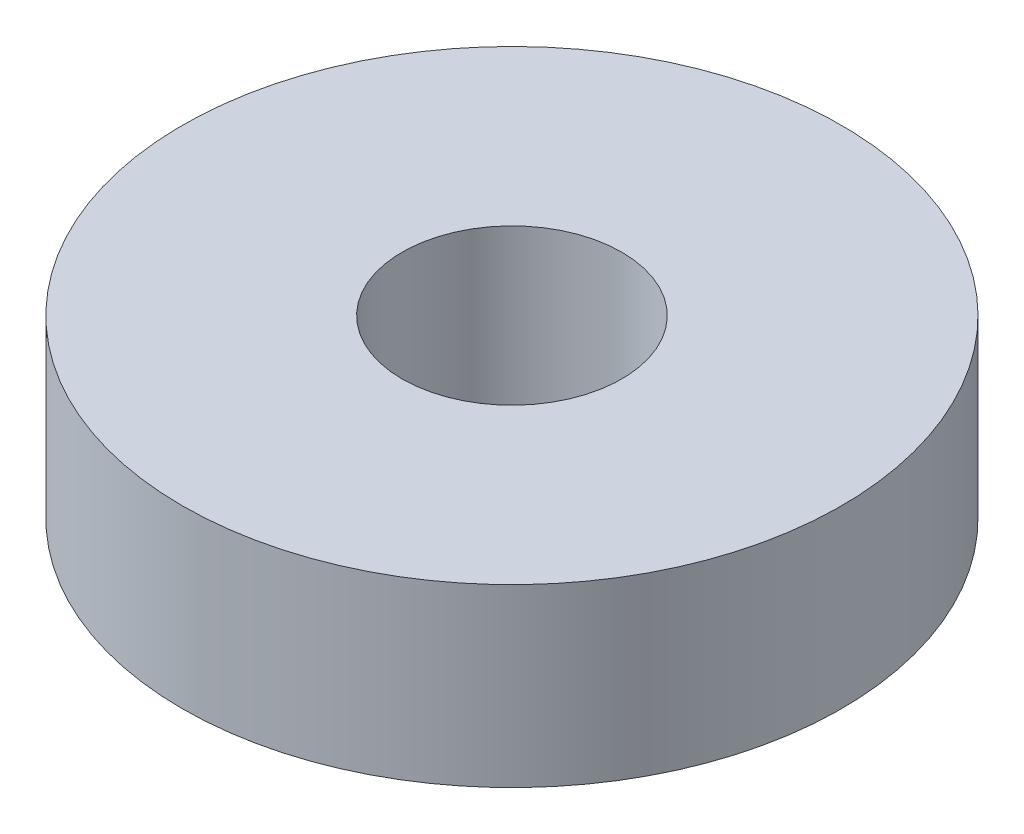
from build123d import *

# Parameters (mm, degrees)
SKETCH_1_R      = 7.5
SKETCH_1_R_2    = 2.5
EXTRUDE_1_DEPTH = 4


with BuildPart() as part:
    # Sketch 1 → Extrude 1 (new body)
    with BuildSketch(Plane(origin=(0, 0, 0), x_dir=(1, 0, 0), z_dir=(0, 1, 0))):
        with Locations(Location((0, 0, 0), (0, 0, 270))):
            Circle(SKETCH_1_R)
        with Locations(Location((0, 0, 0), (0, 0, 270))):
            Circle(SKETCH_1_R_2, mode=Mode.SUBTRACT)
    extrude(amount=EXTRUDE_1_DEPTH)


solid = part.part
